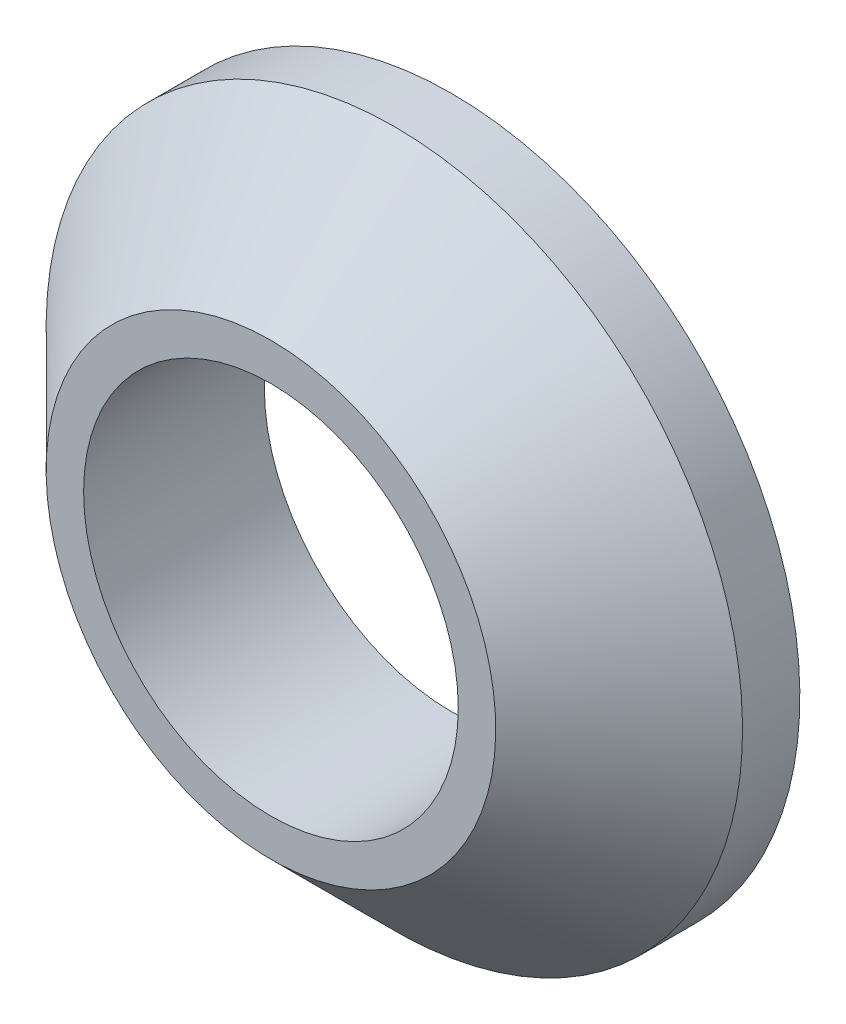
ISO-10303-21;
HEADER;
FILE_DESCRIPTION(('STEP AP214'),'2;1');
FILE_NAME('part.step','',(''),(''),'','','');
FILE_SCHEMA(('AUTOMOTIVE_DESIGN { 1 0 10303 214 1 1 1 1 }'));
ENDSEC;
DATA;
#1=APPLICATION_CONTEXT('core data for automotive mechanical design processes');
#2=APPLICATION_PROTOCOL_DEFINITION('international standard','automotive_design',2000,#1);
#3=PRODUCT_CONTEXT('',#1,'mechanical');
#4=PRODUCT('Part','Part','',(#3));
#5=PRODUCT_RELATED_PRODUCT_CATEGORY('part','',(#4));
#6=PRODUCT_DEFINITION_FORMATION('','',#4);
#7=PRODUCT_DEFINITION_CONTEXT('part definition',#1,'design');
#8=PRODUCT_DEFINITION('design','',#6,#7);
#9=PRODUCT_DEFINITION_SHAPE('','',#8);
#10=(LENGTH_UNIT() NAMED_UNIT(*) SI_UNIT(.MILLI.,.METRE.));
#11=(NAMED_UNIT(*) PLANE_ANGLE_UNIT() SI_UNIT($,.RADIAN.));
#12=(NAMED_UNIT(*) SI_UNIT($,.STERADIAN.) SOLID_ANGLE_UNIT());
#13=UNCERTAINTY_MEASURE_WITH_UNIT(LENGTH_MEASURE(1.E-05),#10,'distance_accuracy_value','');
#14=(GEOMETRIC_REPRESENTATION_CONTEXT(3) GLOBAL_UNCERTAINTY_ASSIGNED_CONTEXT((#13)) GLOBAL_UNIT_ASSIGNED_CONTEXT((#10,
#11,#12)) REPRESENTATION_CONTEXT('',''));
#15=CARTESIAN_POINT('',(0.,0.,0.));
#16=DIRECTION('',(0.,0.,1.));
#17=DIRECTION('',(1.,0.,0.));
#18=AXIS2_PLACEMENT_3D('',#15,#16,#17);
#19=CARTESIAN_POINT('',(7.9,0.,0.));
#20=DIRECTION('',(0.,0.,-1.));
#21=DIRECTION('',(0.,1.,0.));
#22=AXIS2_PLACEMENT_3D('',#19,#20,#21);
#23=PLANE('',#22);
#24=CARTESIAN_POINT('',(0.,0.,0.));
#25=DIRECTION('',(0.,0.,-1.));
#26=DIRECTION('',(0.,1.,0.));
#27=AXIS2_PLACEMENT_3D('',#24,#25,#26);
#28=CIRCLE('',#27,7.9);
#29=CARTESIAN_POINT('',(0.,7.9,0.));
#30=VERTEX_POINT('',#29);
#31=EDGE_CURVE('E31',#30,#30,#28,.T.);
#32=ORIENTED_EDGE('',*,*,#31,.T.);
#33=EDGE_LOOP('',(#32));
#34=FACE_BOUND('',#33,.T.);
#35=CARTESIAN_POINT('',(0.,0.,0.));
#36=DIRECTION('',(0.,0.,-1.));
#37=DIRECTION('',(0.,1.,0.));
#38=AXIS2_PLACEMENT_3D('',#35,#36,#37);
#39=CIRCLE('',#38,4.25);
#40=CARTESIAN_POINT('',(0.,4.25,0.));
#41=VERTEX_POINT('',#40);
#42=EDGE_CURVE('E8',#41,#41,#39,.T.);
#43=ORIENTED_EDGE('',*,*,#42,.F.);
#44=EDGE_LOOP('',(#43));
#45=FACE_BOUND('',#44,.T.);
#46=ADVANCED_FACE('F12',(#34,#45),#23,.T.);
#47=CARTESIAN_POINT('',(0.,0.,0.));
#48=DIRECTION('',(0.,0.,-1.));
#49=DIRECTION('',(0.,1.,0.));
#50=AXIS2_PLACEMENT_3D('',#47,#48,#49);
#51=CYLINDRICAL_SURFACE('',#50,4.25);
#52=ORIENTED_EDGE('',*,*,#42,.T.);
#53=EDGE_LOOP('',(#52));
#54=FACE_BOUND('',#53,.T.);
#55=CARTESIAN_POINT('',(0.,0.,4.1));
#56=DIRECTION('',(0.,0.,-1.));
#57=DIRECTION('',(0.,1.,0.));
#58=AXIS2_PLACEMENT_3D('',#55,#56,#57);
#59=CIRCLE('',#58,4.25);
#60=CARTESIAN_POINT('',(0.,4.25,4.1));
#61=VERTEX_POINT('',#60);
#62=EDGE_CURVE('E18',#61,#61,#59,.T.);
#63=ORIENTED_EDGE('',*,*,#62,.F.);
#64=EDGE_LOOP('',(#63));
#65=FACE_BOUND('',#64,.T.);
#66=ADVANCED_FACE('F51',(#54,#65),#51,.F.);
#67=CARTESIAN_POINT('',(4.25,0.,4.1));
#68=DIRECTION('',(0.,0.,1.));
#69=DIRECTION('',(0.,-1.,0.));
#70=AXIS2_PLACEMENT_3D('',#67,#68,#69);
#71=PLANE('',#70);
#72=ORIENTED_EDGE('',*,*,#62,.T.);
#73=EDGE_LOOP('',(#72));
#74=FACE_BOUND('',#73,.T.);
#75=CARTESIAN_POINT('',(0.,0.,4.1));
#76=DIRECTION('',(0.,0.,-1.));
#77=DIRECTION('',(0.,1.,0.));
#78=AXIS2_PLACEMENT_3D('',#75,#76,#77);
#79=CIRCLE('',#78,5.1);
#80=CARTESIAN_POINT('',(0.,5.1,4.1));
#81=VERTEX_POINT('',#80);
#82=EDGE_CURVE('E22',#81,#81,#79,.T.);
#83=ORIENTED_EDGE('',*,*,#82,.F.);
#84=EDGE_LOOP('',(#83));
#85=FACE_BOUND('',#84,.T.);
#86=ADVANCED_FACE('F47',(#74,#85),#71,.T.);
#87=CARTESIAN_POINT('',(0.,0.,1.3));
#88=DIRECTION('',(0.,0.,-1.));
#89=DIRECTION('',(0.,1.,0.));
#90=AXIS2_PLACEMENT_3D('',#87,#88,#89);
#91=CONICAL_SURFACE('',#90,7.9,0.785398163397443);
#92=ORIENTED_EDGE('',*,*,#82,.T.);
#93=EDGE_LOOP('',(#92));
#94=FACE_BOUND('',#93,.T.);
#95=CARTESIAN_POINT('',(0.,0.,1.3));
#96=DIRECTION('',(0.,0.,-1.));
#97=DIRECTION('',(0.,1.,0.));
#98=AXIS2_PLACEMENT_3D('',#95,#96,#97);
#99=CIRCLE('',#98,7.9);
#100=CARTESIAN_POINT('',(0.,7.9,1.3));
#101=VERTEX_POINT('',#100);
#102=EDGE_CURVE('E26',#101,#101,#99,.T.);
#103=ORIENTED_EDGE('',*,*,#102,.F.);
#104=EDGE_LOOP('',(#103));
#105=FACE_BOUND('',#104,.T.);
#106=ADVANCED_FACE('F39',(#94,#105),#91,.T.);
#107=CARTESIAN_POINT('',(0.,0.,0.));
#108=DIRECTION('',(0.,0.,-1.));
#109=DIRECTION('',(0.,1.,0.));
#110=AXIS2_PLACEMENT_3D('',#107,#108,#109);
#111=CYLINDRICAL_SURFACE('',#110,7.9);
#112=ORIENTED_EDGE('',*,*,#102,.T.);
#113=EDGE_LOOP('',(#112));
#114=FACE_BOUND('',#113,.T.);
#115=ORIENTED_EDGE('',*,*,#31,.F.);
#116=EDGE_LOOP('',(#115));
#117=FACE_BOUND('',#116,.T.);
#118=ADVANCED_FACE('F37',(#114,#117),#111,.T.);
#119=CLOSED_SHELL('',(#46,#66,#86,#106,#118));
#120=MANIFOLD_SOLID_BREP('B1',#119);
#121=ADVANCED_BREP_SHAPE_REPRESENTATION('',(#18,#120),#14);
#122=SHAPE_DEFINITION_REPRESENTATION(#9,#121);
ENDSEC;
END-ISO-10303-21;
